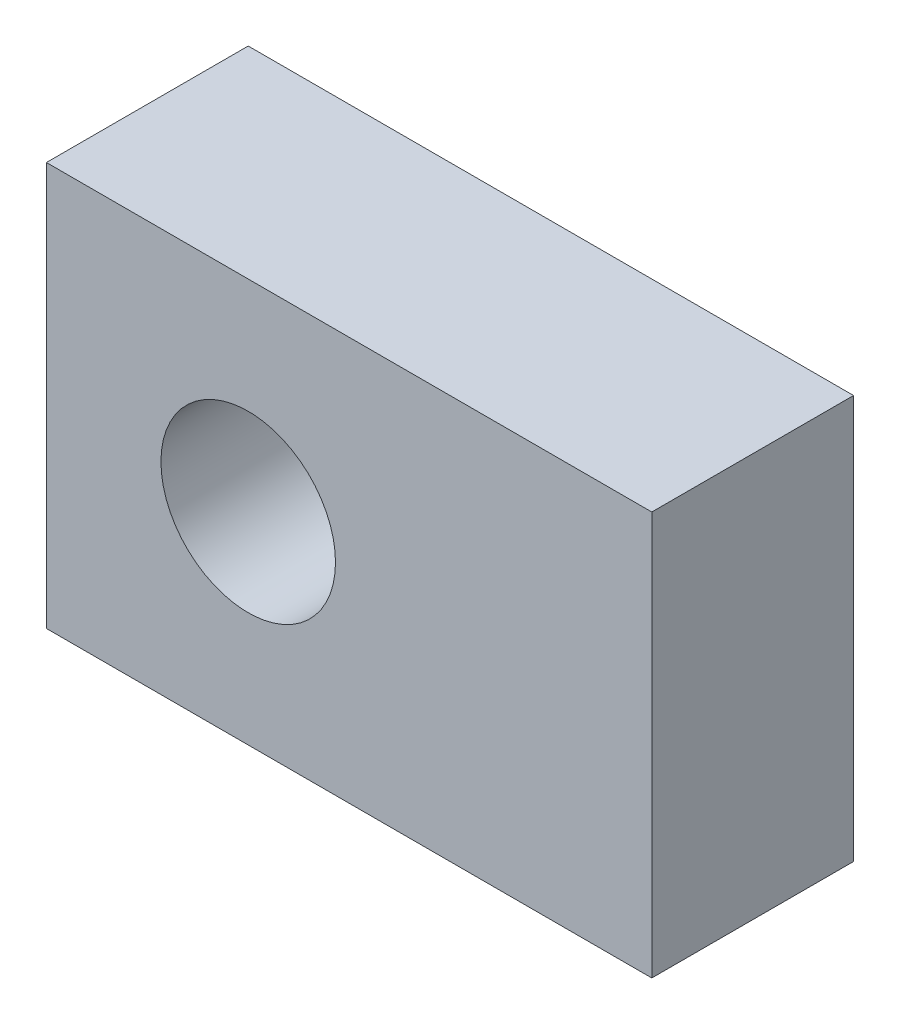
ISO-10303-21;
HEADER;
FILE_DESCRIPTION(('STEP AP214'),'2;1');
FILE_NAME('part.step','',(''),(''),'','','');
FILE_SCHEMA(('AUTOMOTIVE_DESIGN { 1 0 10303 214 1 1 1 1 }'));
ENDSEC;
DATA;
#1=APPLICATION_CONTEXT('core data for automotive mechanical design processes');
#2=APPLICATION_PROTOCOL_DEFINITION('international standard','automotive_design',2000,#1);
#3=PRODUCT_CONTEXT('',#1,'mechanical');
#4=PRODUCT('Part','Part','',(#3));
#5=PRODUCT_RELATED_PRODUCT_CATEGORY('part','',(#4));
#6=PRODUCT_DEFINITION_FORMATION('','',#4);
#7=PRODUCT_DEFINITION_CONTEXT('part definition',#1,'design');
#8=PRODUCT_DEFINITION('design','',#6,#7);
#9=PRODUCT_DEFINITION_SHAPE('','',#8);
#10=(LENGTH_UNIT() NAMED_UNIT(*) SI_UNIT(.MILLI.,.METRE.));
#11=(NAMED_UNIT(*) PLANE_ANGLE_UNIT() SI_UNIT($,.RADIAN.));
#12=(NAMED_UNIT(*) SI_UNIT($,.STERADIAN.) SOLID_ANGLE_UNIT());
#13=UNCERTAINTY_MEASURE_WITH_UNIT(LENGTH_MEASURE(1.E-05),#10,'distance_accuracy_value','');
#14=(GEOMETRIC_REPRESENTATION_CONTEXT(3) GLOBAL_UNCERTAINTY_ASSIGNED_CONTEXT((#13)) GLOBAL_UNIT_ASSIGNED_CONTEXT((#10,
#11,#12)) REPRESENTATION_CONTEXT('',''));
#15=CARTESIAN_POINT('',(0.,0.,0.));
#16=DIRECTION('',(0.,0.,1.));
#17=DIRECTION('',(1.,0.,0.));
#18=AXIS2_PLACEMENT_3D('',#15,#16,#17);
#19=CARTESIAN_POINT('',(0.,0.,20.));
#20=DIRECTION('',(0.,0.,1.));
#21=DIRECTION('',(1.,0.,0.));
#22=AXIS2_PLACEMENT_3D('',#19,#20,#21);
#23=PLANE('',#22);
#24=DIRECTION('',(0.,-1.,0.));
#25=VECTOR('',#24,1.);
#26=CARTESIAN_POINT('',(0.,-20.,20.));
#27=LINE('',#26,#25);
#28=CARTESIAN_POINT('',(0.,20.,20.));
#29=VERTEX_POINT('',#28);
#30=CARTESIAN_POINT('',(0.,-20.,20.));
#31=VERTEX_POINT('',#30);
#32=EDGE_CURVE('E84',#29,#31,#27,.T.);
#33=ORIENTED_EDGE('',*,*,#32,.T.);
#34=DIRECTION('',(1.,0.,0.));
#35=VECTOR('',#34,1.);
#36=CARTESIAN_POINT('',(60.,-20.,20.));
#37=LINE('',#36,#35);
#38=CARTESIAN_POINT('',(60.,-20.,20.));
#39=VERTEX_POINT('',#38);
#40=EDGE_CURVE('E79',#31,#39,#37,.T.);
#41=ORIENTED_EDGE('',*,*,#40,.T.);
#42=DIRECTION('',(0.,1.,0.));
#43=VECTOR('',#42,1.);
#44=CARTESIAN_POINT('',(60.,-20.,20.));
#45=LINE('',#44,#43);
#46=CARTESIAN_POINT('',(60.,20.,20.));
#47=VERTEX_POINT('',#46);
#48=EDGE_CURVE('E82',#39,#47,#45,.T.);
#49=ORIENTED_EDGE('',*,*,#48,.T.);
#50=DIRECTION('',(-1.,0.,0.));
#51=VECTOR('',#50,1.);
#52=CARTESIAN_POINT('',(60.,20.,20.));
#53=LINE('',#52,#51);
#54=EDGE_CURVE('E49',#47,#29,#53,.T.);
#55=ORIENTED_EDGE('',*,*,#54,.T.);
#56=EDGE_LOOP('',(#33,#41,#49,#55));
#57=FACE_BOUND('',#56,.T.);
#58=CARTESIAN_POINT('',(20.,0.,20.));
#59=DIRECTION('',(0.,0.,1.));
#60=DIRECTION('',(1.,0.,0.));
#61=AXIS2_PLACEMENT_3D('',#58,#59,#60);
#62=CIRCLE('',#61,8.65);
#63=CARTESIAN_POINT('',(28.65,0.,20.));
#64=VERTEX_POINT('',#63);
#65=EDGE_CURVE('E99',#64,#64,#62,.T.);
#66=ORIENTED_EDGE('',*,*,#65,.F.);
#67=EDGE_LOOP('',(#66));
#68=FACE_BOUND('',#67,.T.);
#69=ADVANCED_FACE('F32',(#57,#68),#23,.T.);
#70=CARTESIAN_POINT('',(0.,0.,0.));
#71=DIRECTION('',(0.,0.,1.));
#72=DIRECTION('',(1.,0.,0.));
#73=AXIS2_PLACEMENT_3D('',#70,#71,#72);
#74=PLANE('',#73);
#75=DIRECTION('',(0.,-1.,0.));
#76=VECTOR('',#75,1.);
#77=CARTESIAN_POINT('',(0.,-20.,0.));
#78=LINE('',#77,#76);
#79=CARTESIAN_POINT('',(0.,20.,0.));
#80=VERTEX_POINT('',#79);
#81=CARTESIAN_POINT('',(0.,-20.,0.));
#82=VERTEX_POINT('',#81);
#83=EDGE_CURVE('E96',#80,#82,#78,.T.);
#84=ORIENTED_EDGE('',*,*,#83,.F.);
#85=DIRECTION('',(-1.,0.,0.));
#86=VECTOR('',#85,1.);
#87=CARTESIAN_POINT('',(60.,20.,0.));
#88=LINE('',#87,#86);
#89=CARTESIAN_POINT('',(60.,20.,0.));
#90=VERTEX_POINT('',#89);
#91=EDGE_CURVE('E72',#90,#80,#88,.T.);
#92=ORIENTED_EDGE('',*,*,#91,.F.);
#93=DIRECTION('',(0.,1.,0.));
#94=VECTOR('',#93,1.);
#95=CARTESIAN_POINT('',(60.,-20.,0.));
#96=LINE('',#95,#94);
#97=CARTESIAN_POINT('',(60.,-20.,0.));
#98=VERTEX_POINT('',#97);
#99=EDGE_CURVE('E66',#98,#90,#96,.T.);
#100=ORIENTED_EDGE('',*,*,#99,.F.);
#101=DIRECTION('',(1.,0.,0.));
#102=VECTOR('',#101,1.);
#103=CARTESIAN_POINT('',(60.,-20.,0.));
#104=LINE('',#103,#102);
#105=EDGE_CURVE('E88',#82,#98,#104,.T.);
#106=ORIENTED_EDGE('',*,*,#105,.F.);
#107=EDGE_LOOP('',(#84,#92,#100,#106));
#108=FACE_BOUND('',#107,.T.);
#109=CARTESIAN_POINT('',(20.,0.,0.));
#110=DIRECTION('',(0.,0.,1.));
#111=DIRECTION('',(1.,0.,0.));
#112=AXIS2_PLACEMENT_3D('',#109,#110,#111);
#113=CIRCLE('',#112,8.65);
#114=CARTESIAN_POINT('',(28.65,0.,0.));
#115=VERTEX_POINT('',#114);
#116=EDGE_CURVE('E111',#115,#115,#113,.T.);
#117=ORIENTED_EDGE('',*,*,#116,.T.);
#118=EDGE_LOOP('',(#117));
#119=FACE_BOUND('',#118,.T.);
#120=ADVANCED_FACE('F107',(#108,#119),#74,.F.);
#121=CARTESIAN_POINT('',(0.,-20.,20.));
#122=DIRECTION('',(1.,0.,0.));
#123=DIRECTION('',(0.,0.,-1.));
#124=AXIS2_PLACEMENT_3D('',#121,#122,#123);
#125=PLANE('',#124);
#126=ORIENTED_EDGE('',*,*,#83,.T.);
#127=DIRECTION('',(0.,0.,-1.));
#128=VECTOR('',#127,1.);
#129=CARTESIAN_POINT('',(0.,-20.,20.));
#130=LINE('',#129,#128);
#131=EDGE_CURVE('E11',#31,#82,#130,.T.);
#132=ORIENTED_EDGE('',*,*,#131,.F.);
#133=ORIENTED_EDGE('',*,*,#32,.F.);
#134=DIRECTION('',(0.,0.,-1.));
#135=VECTOR('',#134,1.);
#136=CARTESIAN_POINT('',(0.,20.,20.));
#137=LINE('',#136,#135);
#138=EDGE_CURVE('E92',#29,#80,#137,.T.);
#139=ORIENTED_EDGE('',*,*,#138,.T.);
#140=EDGE_LOOP('',(#126,#132,#133,#139));
#141=FACE_BOUND('',#140,.T.);
#142=ADVANCED_FACE('F34',(#141),#125,.F.);
#143=CARTESIAN_POINT('',(60.,-20.,20.));
#144=DIRECTION('',(0.,1.,0.));
#145=DIRECTION('',(-1.,0.,0.));
#146=AXIS2_PLACEMENT_3D('',#143,#144,#145);
#147=PLANE('',#146);
#148=ORIENTED_EDGE('',*,*,#105,.T.);
#149=DIRECTION('',(0.,0.,-1.));
#150=VECTOR('',#149,1.);
#151=CARTESIAN_POINT('',(60.,-20.,20.));
#152=LINE('',#151,#150);
#153=EDGE_CURVE('E41',#39,#98,#152,.T.);
#154=ORIENTED_EDGE('',*,*,#153,.F.);
#155=ORIENTED_EDGE('',*,*,#40,.F.);
#156=ORIENTED_EDGE('',*,*,#131,.T.);
#157=EDGE_LOOP('',(#148,#154,#155,#156));
#158=FACE_BOUND('',#157,.T.);
#159=ADVANCED_FACE('F87',(#158),#147,.F.);
#160=CARTESIAN_POINT('',(60.,-20.,20.));
#161=DIRECTION('',(-1.,0.,0.));
#162=DIRECTION('',(0.,0.,1.));
#163=AXIS2_PLACEMENT_3D('',#160,#161,#162);
#164=PLANE('',#163);
#165=ORIENTED_EDGE('',*,*,#99,.T.);
#166=DIRECTION('',(0.,0.,-1.));
#167=VECTOR('',#166,1.);
#168=CARTESIAN_POINT('',(60.,20.,20.));
#169=LINE('',#168,#167);
#170=EDGE_CURVE('E89',#47,#90,#169,.T.);
#171=ORIENTED_EDGE('',*,*,#170,.F.);
#172=ORIENTED_EDGE('',*,*,#48,.F.);
#173=ORIENTED_EDGE('',*,*,#153,.T.);
#174=EDGE_LOOP('',(#165,#171,#172,#173));
#175=FACE_BOUND('',#174,.T.);
#176=ADVANCED_FACE('F90',(#175),#164,.F.);
#177=CARTESIAN_POINT('',(60.,20.,20.));
#178=DIRECTION('',(0.,-1.,0.));
#179=DIRECTION('',(1.,0.,0.));
#180=AXIS2_PLACEMENT_3D('',#177,#178,#179);
#181=PLANE('',#180);
#182=ORIENTED_EDGE('',*,*,#91,.T.);
#183=ORIENTED_EDGE('',*,*,#138,.F.);
#184=ORIENTED_EDGE('',*,*,#54,.F.);
#185=ORIENTED_EDGE('',*,*,#170,.T.);
#186=EDGE_LOOP('',(#182,#183,#184,#185));
#187=FACE_BOUND('',#186,.T.);
#188=ADVANCED_FACE('F104',(#187),#181,.F.);
#189=CARTESIAN_POINT('',(20.,0.,20.));
#190=DIRECTION('',(0.,0.,-1.));
#191=DIRECTION('',(-1.,0.,0.));
#192=AXIS2_PLACEMENT_3D('',#189,#190,#191);
#193=CYLINDRICAL_SURFACE('',#192,8.65);
#194=ORIENTED_EDGE('',*,*,#65,.T.);
#195=EDGE_LOOP('',(#194));
#196=FACE_BOUND('',#195,.T.);
#197=ORIENTED_EDGE('',*,*,#116,.F.);
#198=EDGE_LOOP('',(#197));
#199=FACE_BOUND('',#198,.T.);
#200=ADVANCED_FACE('F117',(#196,#199),#193,.F.);
#201=CLOSED_SHELL('',(#69,#120,#142,#159,#176,#188,#200));
#202=MANIFOLD_SOLID_BREP('B2',#201);
#203=ADVANCED_BREP_SHAPE_REPRESENTATION('',(#18,#202),#14);
#204=SHAPE_DEFINITION_REPRESENTATION(#9,#203);
ENDSEC;
END-ISO-10303-21;
